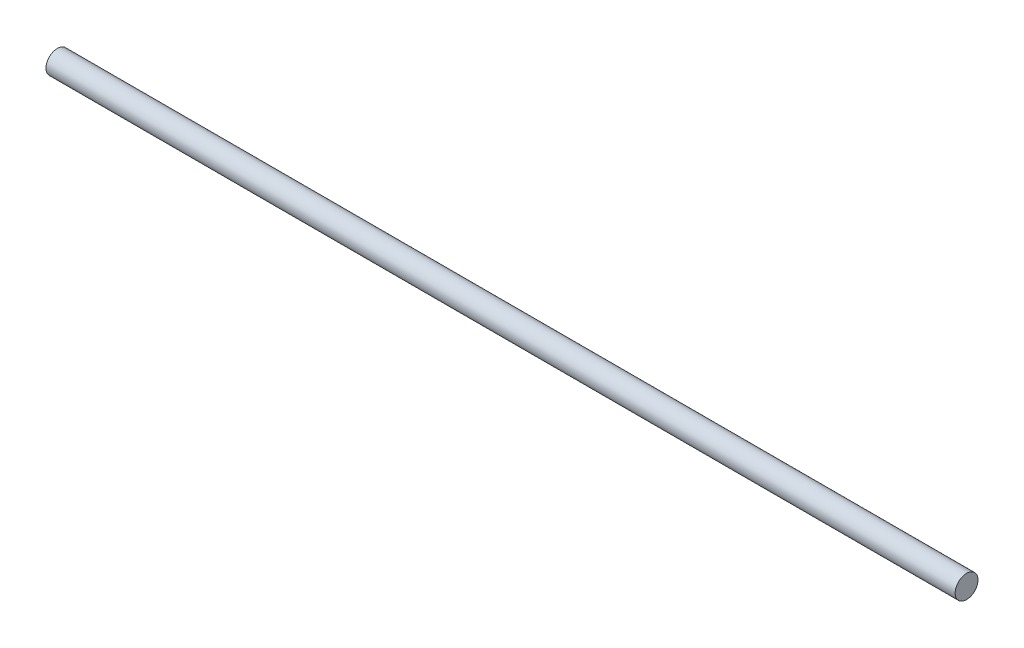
from build123d import *

# Parameters (mm, degrees)
SKETCH1_R         = 7.9375
SCREWLENGTH_DEPTH = 632.46


with BuildPart() as part:
    # Sketch1 → SCREWLength (new body)
    with BuildSketch(Plane(origin=(0, 0, 0), x_dir=(0, 0, -1), z_dir=(1, 0, 0))):
        Circle(SKETCH1_R)
    extrude(amount=SCREWLENGTH_DEPTH)


solid = part.part
